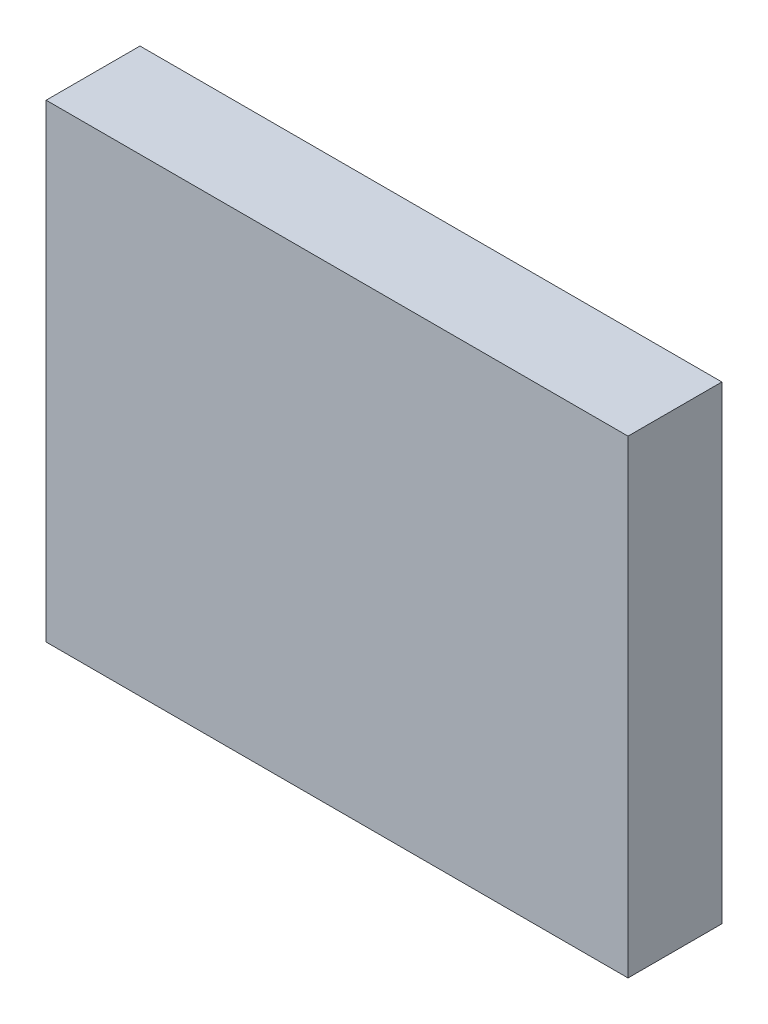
ISO-10303-21;
HEADER;
FILE_DESCRIPTION(('STEP AP214'),'2;1');
FILE_NAME('part.step','',(''),(''),'','','');
FILE_SCHEMA(('AUTOMOTIVE_DESIGN { 1 0 10303 214 1 1 1 1 }'));
ENDSEC;
DATA;
#1=APPLICATION_CONTEXT('core data for automotive mechanical design processes');
#2=APPLICATION_PROTOCOL_DEFINITION('international standard','automotive_design',2000,#1);
#3=PRODUCT_CONTEXT('',#1,'mechanical');
#4=PRODUCT('Part','Part','',(#3));
#5=PRODUCT_RELATED_PRODUCT_CATEGORY('part','',(#4));
#6=PRODUCT_DEFINITION_FORMATION('','',#4);
#7=PRODUCT_DEFINITION_CONTEXT('part definition',#1,'design');
#8=PRODUCT_DEFINITION('design','',#6,#7);
#9=PRODUCT_DEFINITION_SHAPE('','',#8);
#10=(LENGTH_UNIT() NAMED_UNIT(*) SI_UNIT(.MILLI.,.METRE.));
#11=(NAMED_UNIT(*) PLANE_ANGLE_UNIT() SI_UNIT($,.RADIAN.));
#12=(NAMED_UNIT(*) SI_UNIT($,.STERADIAN.) SOLID_ANGLE_UNIT());
#13=UNCERTAINTY_MEASURE_WITH_UNIT(LENGTH_MEASURE(1.E-05),#10,'distance_accuracy_value','');
#14=(GEOMETRIC_REPRESENTATION_CONTEXT(3) GLOBAL_UNCERTAINTY_ASSIGNED_CONTEXT((#13)) GLOBAL_UNIT_ASSIGNED_CONTEXT((#10,
#11,#12)) REPRESENTATION_CONTEXT('',''));
#15=CARTESIAN_POINT('',(0.,0.,0.));
#16=DIRECTION('',(0.,0.,1.));
#17=DIRECTION('',(1.,0.,0.));
#18=AXIS2_PLACEMENT_3D('',#15,#16,#17);
#19=CARTESIAN_POINT('',(0.,0.,10.));
#20=DIRECTION('',(1.,0.,0.));
#21=DIRECTION('',(0.,0.,-1.));
#22=AXIS2_PLACEMENT_3D('',#19,#20,#21);
#23=PLANE('',#22);
#24=DIRECTION('',(0.,-1.,0.));
#25=VECTOR('',#24,1.);
#26=CARTESIAN_POINT('',(0.,0.,0.));
#27=LINE('',#26,#25);
#28=CARTESIAN_POINT('',(0.,50.,0.));
#29=VERTEX_POINT('',#28);
#30=CARTESIAN_POINT('',(0.,0.,0.));
#31=VERTEX_POINT('',#30);
#32=EDGE_CURVE('E96',#29,#31,#27,.T.);
#33=ORIENTED_EDGE('',*,*,#32,.T.);
#34=DIRECTION('',(0.,0.,-1.));
#35=VECTOR('',#34,1.);
#36=CARTESIAN_POINT('',(0.,0.,10.));
#37=LINE('',#36,#35);
#38=CARTESIAN_POINT('',(0.,0.,10.));
#39=VERTEX_POINT('',#38);
#40=EDGE_CURVE('E11',#39,#31,#37,.T.);
#41=ORIENTED_EDGE('',*,*,#40,.F.);
#42=DIRECTION('',(0.,-1.,0.));
#43=VECTOR('',#42,1.);
#44=CARTESIAN_POINT('',(0.,0.,10.));
#45=LINE('',#44,#43);
#46=CARTESIAN_POINT('',(0.,50.,10.));
#47=VERTEX_POINT('',#46);
#48=EDGE_CURVE('E84',#47,#39,#45,.T.);
#49=ORIENTED_EDGE('',*,*,#48,.F.);
#50=DIRECTION('',(0.,0.,-1.));
#51=VECTOR('',#50,1.);
#52=CARTESIAN_POINT('',(0.,50.,10.));
#53=LINE('',#52,#51);
#54=EDGE_CURVE('E92',#47,#29,#53,.T.);
#55=ORIENTED_EDGE('',*,*,#54,.T.);
#56=EDGE_LOOP('',(#33,#41,#49,#55));
#57=FACE_BOUND('',#56,.T.);
#58=ADVANCED_FACE('F33',(#57),#23,.F.);
#59=CARTESIAN_POINT('',(0.,0.,10.));
#60=DIRECTION('',(0.,1.,0.));
#61=DIRECTION('',(0.,0.,1.));
#62=AXIS2_PLACEMENT_3D('',#59,#60,#61);
#63=PLANE('',#62);
#64=DIRECTION('',(1.,0.,0.));
#65=VECTOR('',#64,1.);
#66=CARTESIAN_POINT('',(0.,0.,0.));
#67=LINE('',#66,#65);
#68=CARTESIAN_POINT('',(62.,0.,0.));
#69=VERTEX_POINT('',#68);
#70=EDGE_CURVE('E88',#31,#69,#67,.T.);
#71=ORIENTED_EDGE('',*,*,#70,.T.);
#72=DIRECTION('',(0.,0.,-1.));
#73=VECTOR('',#72,1.);
#74=CARTESIAN_POINT('',(62.,0.,10.));
#75=LINE('',#74,#73);
#76=CARTESIAN_POINT('',(62.,0.,10.));
#77=VERTEX_POINT('',#76);
#78=EDGE_CURVE('E41',#77,#69,#75,.T.);
#79=ORIENTED_EDGE('',*,*,#78,.F.);
#80=DIRECTION('',(1.,0.,0.));
#81=VECTOR('',#80,1.);
#82=CARTESIAN_POINT('',(0.,0.,10.));
#83=LINE('',#82,#81);
#84=EDGE_CURVE('E79',#39,#77,#83,.T.);
#85=ORIENTED_EDGE('',*,*,#84,.F.);
#86=ORIENTED_EDGE('',*,*,#40,.T.);
#87=EDGE_LOOP('',(#71,#79,#85,#86));
#88=FACE_BOUND('',#87,.T.);
#89=ADVANCED_FACE('F87',(#88),#63,.F.);
#90=CARTESIAN_POINT('',(62.,0.,10.));
#91=DIRECTION('',(-1.,0.,0.));
#92=DIRECTION('',(0.,0.,1.));
#93=AXIS2_PLACEMENT_3D('',#90,#91,#92);
#94=PLANE('',#93);
#95=DIRECTION('',(0.,1.,0.));
#96=VECTOR('',#95,1.);
#97=CARTESIAN_POINT('',(62.,0.,0.));
#98=LINE('',#97,#96);
#99=CARTESIAN_POINT('',(62.,50.,0.));
#100=VERTEX_POINT('',#99);
#101=EDGE_CURVE('E66',#69,#100,#98,.T.);
#102=ORIENTED_EDGE('',*,*,#101,.T.);
#103=DIRECTION('',(0.,0.,-1.));
#104=VECTOR('',#103,1.);
#105=CARTESIAN_POINT('',(62.,50.,10.));
#106=LINE('',#105,#104);
#107=CARTESIAN_POINT('',(62.,50.,10.));
#108=VERTEX_POINT('',#107);
#109=EDGE_CURVE('E89',#108,#100,#106,.T.);
#110=ORIENTED_EDGE('',*,*,#109,.F.);
#111=DIRECTION('',(0.,1.,0.));
#112=VECTOR('',#111,1.);
#113=CARTESIAN_POINT('',(62.,0.,10.));
#114=LINE('',#113,#112);
#115=EDGE_CURVE('E82',#77,#108,#114,.T.);
#116=ORIENTED_EDGE('',*,*,#115,.F.);
#117=ORIENTED_EDGE('',*,*,#78,.T.);
#118=EDGE_LOOP('',(#102,#110,#116,#117));
#119=FACE_BOUND('',#118,.T.);
#120=ADVANCED_FACE('F90',(#119),#94,.F.);
#121=CARTESIAN_POINT('',(0.,50.,10.));
#122=DIRECTION('',(0.,-1.,0.));
#123=DIRECTION('',(0.,0.,-1.));
#124=AXIS2_PLACEMENT_3D('',#121,#122,#123);
#125=PLANE('',#124);
#126=DIRECTION('',(-1.,0.,0.));
#127=VECTOR('',#126,1.);
#128=CARTESIAN_POINT('',(0.,50.,0.));
#129=LINE('',#128,#127);
#130=EDGE_CURVE('E72',#100,#29,#129,.T.);
#131=ORIENTED_EDGE('',*,*,#130,.T.);
#132=ORIENTED_EDGE('',*,*,#54,.F.);
#133=DIRECTION('',(-1.,0.,0.));
#134=VECTOR('',#133,1.);
#135=CARTESIAN_POINT('',(0.,50.,10.));
#136=LINE('',#135,#134);
#137=EDGE_CURVE('E49',#108,#47,#136,.T.);
#138=ORIENTED_EDGE('',*,*,#137,.F.);
#139=ORIENTED_EDGE('',*,*,#109,.T.);
#140=EDGE_LOOP('',(#131,#132,#138,#139));
#141=FACE_BOUND('',#140,.T.);
#142=ADVANCED_FACE('F103',(#141),#125,.F.);
#143=CARTESIAN_POINT('',(0.,0.,10.));
#144=DIRECTION('',(0.,0.,-1.));
#145=DIRECTION('',(-1.,0.,0.));
#146=AXIS2_PLACEMENT_3D('',#143,#144,#145);
#147=PLANE('',#146);
#148=ORIENTED_EDGE('',*,*,#48,.T.);
#149=ORIENTED_EDGE('',*,*,#84,.T.);
#150=ORIENTED_EDGE('',*,*,#115,.T.);
#151=ORIENTED_EDGE('',*,*,#137,.T.);
#152=EDGE_LOOP('',(#148,#149,#150,#151));
#153=FACE_BOUND('',#152,.T.);
#154=ADVANCED_FACE('F80',(#153),#147,.F.);
#155=CARTESIAN_POINT('',(0.,0.,0.));
#156=DIRECTION('',(0.,0.,-1.));
#157=DIRECTION('',(-1.,0.,0.));
#158=AXIS2_PLACEMENT_3D('',#155,#156,#157);
#159=PLANE('',#158);
#160=ORIENTED_EDGE('',*,*,#32,.F.);
#161=ORIENTED_EDGE('',*,*,#130,.F.);
#162=ORIENTED_EDGE('',*,*,#101,.F.);
#163=ORIENTED_EDGE('',*,*,#70,.F.);
#164=EDGE_LOOP('',(#160,#161,#162,#163));
#165=FACE_BOUND('',#164,.T.);
#166=ADVANCED_FACE('F106',(#165),#159,.T.);
#167=CLOSED_SHELL('',(#58,#89,#120,#142,#154,#166));
#168=MANIFOLD_SOLID_BREP('B2',#167);
#169=ADVANCED_BREP_SHAPE_REPRESENTATION('',(#18,#168),#14);
#170=SHAPE_DEFINITION_REPRESENTATION(#9,#169);
ENDSEC;
END-ISO-10303-21;
